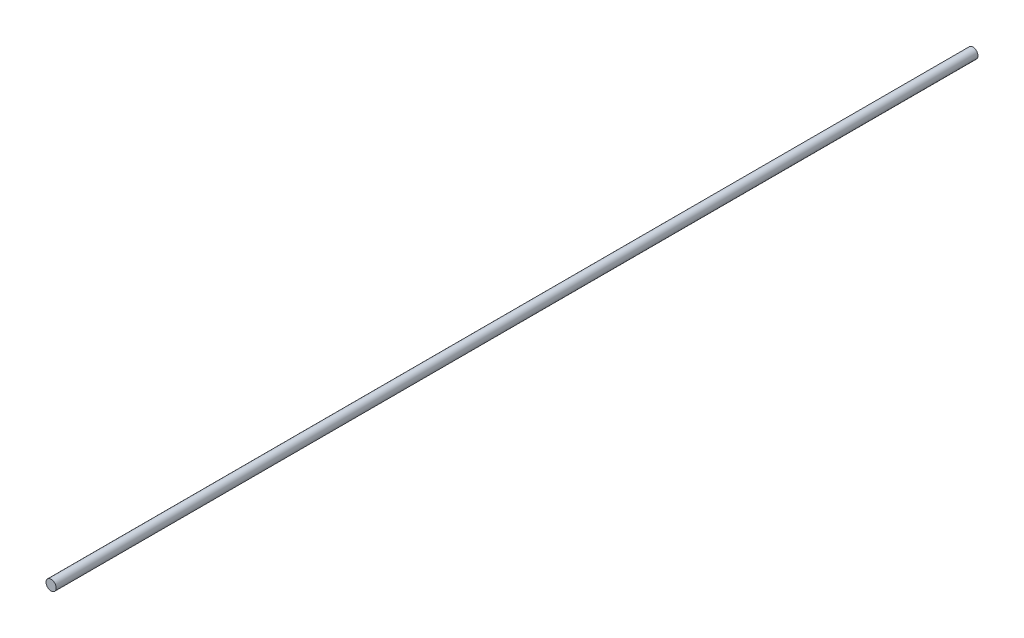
ISO-10303-21;
HEADER;
FILE_DESCRIPTION(('STEP AP214'),'2;1');
FILE_NAME('part.step','',(''),(''),'','','');
FILE_SCHEMA(('AUTOMOTIVE_DESIGN { 1 0 10303 214 1 1 1 1 }'));
ENDSEC;
DATA;
#1=APPLICATION_CONTEXT('core data for automotive mechanical design processes');
#2=APPLICATION_PROTOCOL_DEFINITION('international standard','automotive_design',2000,#1);
#3=PRODUCT_CONTEXT('',#1,'mechanical');
#4=PRODUCT('Part','Part','',(#3));
#5=PRODUCT_RELATED_PRODUCT_CATEGORY('part','',(#4));
#6=PRODUCT_DEFINITION_FORMATION('','',#4);
#7=PRODUCT_DEFINITION_CONTEXT('part definition',#1,'design');
#8=PRODUCT_DEFINITION('design','',#6,#7);
#9=PRODUCT_DEFINITION_SHAPE('','',#8);
#10=(LENGTH_UNIT() NAMED_UNIT(*) SI_UNIT(.MILLI.,.METRE.));
#11=(NAMED_UNIT(*) PLANE_ANGLE_UNIT() SI_UNIT($,.RADIAN.));
#12=(NAMED_UNIT(*) SI_UNIT($,.STERADIAN.) SOLID_ANGLE_UNIT());
#13=UNCERTAINTY_MEASURE_WITH_UNIT(LENGTH_MEASURE(1.E-05),#10,'distance_accuracy_value','');
#14=(GEOMETRIC_REPRESENTATION_CONTEXT(3) GLOBAL_UNCERTAINTY_ASSIGNED_CONTEXT((#13)) GLOBAL_UNIT_ASSIGNED_CONTEXT((#10,
#11,#12)) REPRESENTATION_CONTEXT('',''));
#15=CARTESIAN_POINT('',(0.,0.,0.));
#16=DIRECTION('',(0.,0.,1.));
#17=DIRECTION('',(1.,0.,0.));
#18=AXIS2_PLACEMENT_3D('',#15,#16,#17);
#19=CARTESIAN_POINT('',(0.,0.,-5450.));
#20=DIRECTION('',(0.,0.,1.));
#21=DIRECTION('',(1.,0.,0.));
#22=AXIS2_PLACEMENT_3D('',#19,#20,#21);
#23=CYLINDRICAL_SURFACE('',#22,30.);
#24=CARTESIAN_POINT('',(0.,0.,-5450.));
#25=DIRECTION('',(0.,0.,1.));
#26=DIRECTION('',(1.,0.,0.));
#27=AXIS2_PLACEMENT_3D('',#24,#25,#26);
#28=CIRCLE('',#27,30.);
#29=CARTESIAN_POINT('',(30.,0.,-5450.));
#30=VERTEX_POINT('',#29);
#31=EDGE_CURVE('E10',#30,#30,#28,.T.);
#32=CARTESIAN_POINT('',(0.,0.,0.));
#33=DIRECTION('',(0.,0.,1.));
#34=DIRECTION('',(1.,0.,0.));
#35=AXIS2_PLACEMENT_3D('',#32,#33,#34);
#36=CIRCLE('',#35,30.);
#37=CARTESIAN_POINT('',(30.,0.,0.));
#38=VERTEX_POINT('',#37);
#39=EDGE_CURVE('E40',#38,#38,#36,.T.);
#40=CARTESIAN_POINT('',(30.,0.,-5450.));
#41=CARTESIAN_POINT('',(30.,0.,-5393.22916666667));
#42=CARTESIAN_POINT('',(30.,0.,-5336.45833333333));
#43=CARTESIAN_POINT('',(30.,0.,-5222.91666666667));
#44=CARTESIAN_POINT('',(30.,0.,-5166.14583333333));
#45=CARTESIAN_POINT('',(30.,0.,-5052.60416666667));
#46=CARTESIAN_POINT('',(30.,0.,-4995.83333333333));
#47=CARTESIAN_POINT('',(30.,0.,-4882.29166666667));
#48=CARTESIAN_POINT('',(30.,0.,-4825.52083333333));
#49=CARTESIAN_POINT('',(30.,0.,-4711.97916666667));
#50=CARTESIAN_POINT('',(30.,0.,-4655.20833333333));
#51=CARTESIAN_POINT('',(30.,0.,-4541.66666666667));
#52=CARTESIAN_POINT('',(30.,0.,-4484.89583333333));
#53=CARTESIAN_POINT('',(30.,0.,-4371.35416666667));
#54=CARTESIAN_POINT('',(30.,0.,-4314.58333333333));
#55=CARTESIAN_POINT('',(30.,0.,-4201.04166666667));
#56=CARTESIAN_POINT('',(30.,0.,-4144.27083333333));
#57=CARTESIAN_POINT('',(30.,0.,-4030.72916666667));
#58=CARTESIAN_POINT('',(30.,0.,-3973.95833333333));
#59=CARTESIAN_POINT('',(30.,0.,-3860.41666666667));
#60=CARTESIAN_POINT('',(30.,0.,-3803.64583333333));
#61=CARTESIAN_POINT('',(30.,0.,-3690.10416666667));
#62=CARTESIAN_POINT('',(30.,0.,-3633.33333333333));
#63=CARTESIAN_POINT('',(30.,0.,-3519.79166666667));
#64=CARTESIAN_POINT('',(30.,0.,-3463.02083333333));
#65=CARTESIAN_POINT('',(30.,0.,-3349.47916666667));
#66=CARTESIAN_POINT('',(30.,0.,-3292.70833333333));
#67=CARTESIAN_POINT('',(30.,0.,-3179.16666666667));
#68=CARTESIAN_POINT('',(30.,0.,-3122.39583333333));
#69=CARTESIAN_POINT('',(30.,0.,-3008.85416666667));
#70=CARTESIAN_POINT('',(30.,0.,-2952.08333333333));
#71=CARTESIAN_POINT('',(30.,0.,-2838.54166666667));
#72=CARTESIAN_POINT('',(30.,0.,-2781.77083333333));
#73=CARTESIAN_POINT('',(30.,0.,-2668.22916666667));
#74=CARTESIAN_POINT('',(30.,0.,-2611.45833333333));
#75=CARTESIAN_POINT('',(30.,0.,-2497.91666666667));
#76=CARTESIAN_POINT('',(30.,0.,-2441.14583333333));
#77=CARTESIAN_POINT('',(30.,0.,-2327.60416666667));
#78=CARTESIAN_POINT('',(30.,0.,-2270.83333333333));
#79=CARTESIAN_POINT('',(30.,0.,-2157.29166666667));
#80=CARTESIAN_POINT('',(30.,0.,-2100.52083333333));
#81=CARTESIAN_POINT('',(30.,0.,-1986.97916666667));
#82=CARTESIAN_POINT('',(30.,0.,-1930.20833333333));
#83=CARTESIAN_POINT('',(30.,0.,-1816.66666666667));
#84=CARTESIAN_POINT('',(30.,0.,-1759.89583333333));
#85=CARTESIAN_POINT('',(30.,0.,-1646.35416666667));
#86=CARTESIAN_POINT('',(30.,0.,-1589.58333333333));
#87=CARTESIAN_POINT('',(30.,0.,-1476.04166666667));
#88=CARTESIAN_POINT('',(30.,0.,-1419.27083333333));
#89=CARTESIAN_POINT('',(30.,0.,-1305.72916666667));
#90=CARTESIAN_POINT('',(30.,0.,-1248.95833333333));
#91=CARTESIAN_POINT('',(30.,0.,-1135.41666666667));
#92=CARTESIAN_POINT('',(30.,0.,-1078.64583333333));
#93=CARTESIAN_POINT('',(30.,0.,-965.104166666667));
#94=CARTESIAN_POINT('',(30.,0.,-908.333333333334));
#95=CARTESIAN_POINT('',(30.,0.,-794.791666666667));
#96=CARTESIAN_POINT('',(30.,0.,-738.020833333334));
#97=CARTESIAN_POINT('',(30.,0.,-624.479166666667));
#98=CARTESIAN_POINT('',(30.,0.,-567.708333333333));
#99=CARTESIAN_POINT('',(30.,0.,-454.166666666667));
#100=CARTESIAN_POINT('',(30.,0.,-397.395833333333));
#101=CARTESIAN_POINT('',(30.,0.,-283.854166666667));
#102=CARTESIAN_POINT('',(30.,0.,-227.083333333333));
#103=CARTESIAN_POINT('',(30.,0.,-113.541666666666));
#104=CARTESIAN_POINT('',(30.,0.,-56.7708333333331));
#105=CARTESIAN_POINT('',(30.,0.,0.));
#106=B_SPLINE_CURVE_WITH_KNOTS('',3,(#40,#41,#42,#43,#44,#45,#46,#47,#48,#49,#50,#51,#52,#53,
#54,#55,#56,#57,#58,#59,#60,#61,#62,#63,#64,#65,#66,#67,#68,#69,#70,#71,#72,#73,#74,#75,#76,#77,
#78,#79,#80,#81,#82,#83,#84,#85,#86,#87,#88,#89,#90,#91,#92,#93,#94,#95,#96,#97,#98,#99,#100,
#101,#102,#103,#104,#105),.UNSPECIFIED.,.F.,.F.,(4,2,2,2,2,2,2,2,2,2,2,2,2,2,2,2,2,2,2,2,2,2,2,
2,2,2,2,2,2,2,2,2,4),(0.,170.3125,340.624999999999,510.9375,681.249999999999,851.5625,1021.875,
1192.1875,1362.5,1532.8125,1703.125,1873.4375,2043.75,2214.0625,2384.375,2554.6875,2725.,
2895.3125,3065.625,3235.9375,3406.25,3576.5625,3746.875,3917.1875,4087.5,4257.8125,4428.125,
4598.4375,4768.75,4939.0625,5109.375,5279.6875,5450.),.UNSPECIFIED.);
#107=EDGE_CURVE('BSEAM37',#30,#38,#106,.T.);
#108=ORIENTED_EDGE('',*,*,#31,.T.);
#109=ORIENTED_EDGE('',*,*,#39,.F.);
#110=ORIENTED_EDGE('',*,*,#107,.T.);
#111=ORIENTED_EDGE('',*,*,#107,.F.);
#112=EDGE_LOOP('',(#108,#110,#109,#111));
#113=FACE_BOUND('',#112,.T.);
#114=ADVANCED_FACE('F37',(#113),#23,.T.);
#115=CARTESIAN_POINT('',(0.,0.,-5450.));
#116=DIRECTION('',(0.,0.,1.));
#117=DIRECTION('',(1.,0.,0.));
#118=AXIS2_PLACEMENT_3D('',#115,#116,#117);
#119=PLANE('',#118);
#120=ORIENTED_EDGE('',*,*,#31,.F.);
#121=EDGE_LOOP('',(#120));
#122=FACE_BOUND('',#121,.T.);
#123=ADVANCED_FACE('F54',(#122),#119,.F.);
#124=CARTESIAN_POINT('',(0.,0.,0.));
#125=DIRECTION('',(0.,0.,1.));
#126=DIRECTION('',(1.,0.,0.));
#127=AXIS2_PLACEMENT_3D('',#124,#125,#126);
#128=PLANE('',#127);
#129=ORIENTED_EDGE('',*,*,#39,.T.);
#130=EDGE_LOOP('',(#129));
#131=FACE_BOUND('',#130,.T.);
#132=ADVANCED_FACE('F51',(#131),#128,.T.);
#133=CLOSED_SHELL('',(#114,#123,#132));
#134=MANIFOLD_SOLID_BREP('B2',#133);
#135=ADVANCED_BREP_SHAPE_REPRESENTATION('',(#18,#134),#14);
#136=SHAPE_DEFINITION_REPRESENTATION(#9,#135);
ENDSEC;
END-ISO-10303-21;
